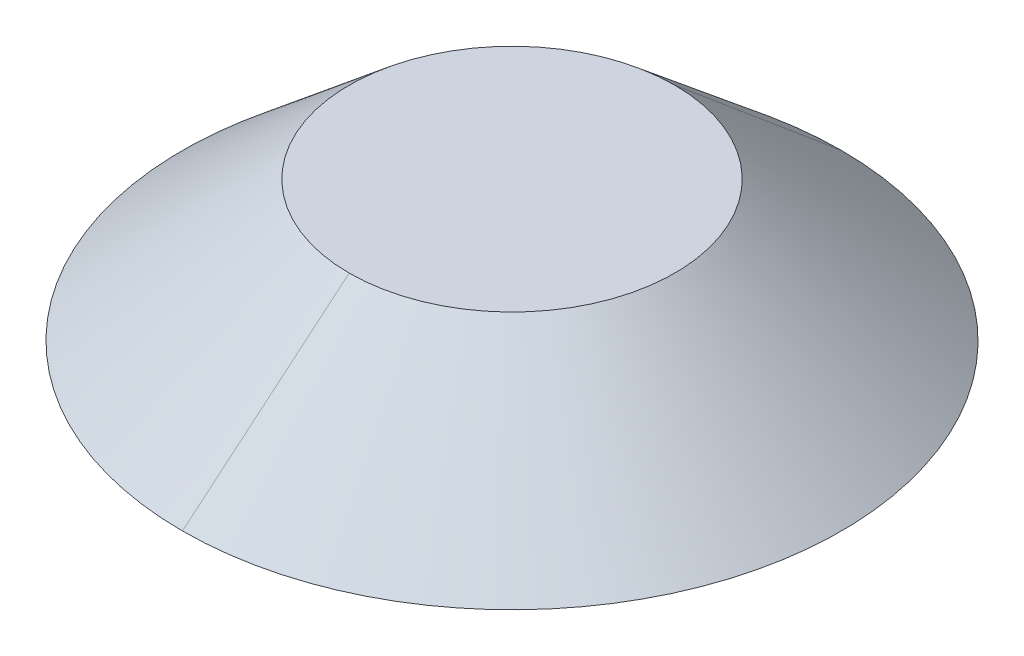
ISO-10303-21;
HEADER;
FILE_DESCRIPTION(('STEP AP214'),'2;1');
FILE_NAME('part.step','',(''),(''),'','','');
FILE_SCHEMA(('AUTOMOTIVE_DESIGN { 1 0 10303 214 1 1 1 1 }'));
ENDSEC;
DATA;
#1=APPLICATION_CONTEXT('core data for automotive mechanical design processes');
#2=APPLICATION_PROTOCOL_DEFINITION('international standard','automotive_design',2000,#1);
#3=PRODUCT_CONTEXT('',#1,'mechanical');
#4=PRODUCT('Part','Part','',(#3));
#5=PRODUCT_RELATED_PRODUCT_CATEGORY('part','',(#4));
#6=PRODUCT_DEFINITION_FORMATION('','',#4);
#7=PRODUCT_DEFINITION_CONTEXT('part definition',#1,'design');
#8=PRODUCT_DEFINITION('design','',#6,#7);
#9=PRODUCT_DEFINITION_SHAPE('','',#8);
#10=(LENGTH_UNIT() NAMED_UNIT(*) SI_UNIT(.MILLI.,.METRE.));
#11=(NAMED_UNIT(*) PLANE_ANGLE_UNIT() SI_UNIT($,.RADIAN.));
#12=(NAMED_UNIT(*) SI_UNIT($,.STERADIAN.) SOLID_ANGLE_UNIT());
#13=UNCERTAINTY_MEASURE_WITH_UNIT(LENGTH_MEASURE(1.E-05),#10,'distance_accuracy_value','');
#14=(GEOMETRIC_REPRESENTATION_CONTEXT(3) GLOBAL_UNCERTAINTY_ASSIGNED_CONTEXT((#13)) GLOBAL_UNIT_ASSIGNED_CONTEXT((#10,
#11,#12)) REPRESENTATION_CONTEXT('',''));
#15=CARTESIAN_POINT('',(0.,0.,0.));
#16=DIRECTION('',(0.,0.,1.));
#17=DIRECTION('',(1.,0.,0.));
#18=AXIS2_PLACEMENT_3D('',#15,#16,#17);
#19=CARTESIAN_POINT('',(0.,0.13853534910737,0.));
#20=DIRECTION('',(0.,-1.,0.));
#21=DIRECTION('',(0.,0.,-1.));
#22=AXIS2_PLACEMENT_3D('',#19,#20,#21);
#23=PLANE('',#22);
#24=CARTESIAN_POINT('',(0.,0.13853534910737,0.));
#25=DIRECTION('',(0.,-1.,0.));
#26=DIRECTION('',(0.,0.,-1.));
#27=AXIS2_PLACEMENT_3D('',#24,#25,#26);
#28=CIRCLE('',#27,2.0828);
#29=CARTESIAN_POINT('',(0.,0.13853534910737,-2.0828));
#30=VERTEX_POINT('',#29);
#31=CARTESIAN_POINT('',(0.,0.13853534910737,2.0828));
#32=VERTEX_POINT('',#31);
#33=EDGE_CURVE('E11',#30,#32,#28,.T.);
#34=ORIENTED_EDGE('',*,*,#33,.F.);
#35=CARTESIAN_POINT('',(0.,0.13853534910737,0.));
#36=DIRECTION('',(0.,-1.,0.));
#37=DIRECTION('',(0.,0.,-1.));
#38=AXIS2_PLACEMENT_3D('',#35,#36,#37);
#39=CIRCLE('',#38,2.0828);
#40=EDGE_CURVE('E25',#32,#30,#39,.T.);
#41=ORIENTED_EDGE('',*,*,#40,.F.);
#42=EDGE_LOOP('',(#34,#41));
#43=FACE_BOUND('',#42,.T.);
#44=ADVANCED_FACE('F17',(#43),#23,.F.);
#45=CARTESIAN_POINT('',(0.,0.13853534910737,0.));
#46=DIRECTION('',(0.,-1.,0.));
#47=DIRECTION('',(1.,0.,0.));
#48=AXIS2_PLACEMENT_3D('',#45,#46,#47);
#49=CONICAL_SURFACE('',#48,2.0828,0.872664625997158);
#50=ORIENTED_EDGE('',*,*,#40,.T.);
#51=CARTESIAN_POINT('',(0.,0.13853534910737,-2.0828));
#52=DIRECTION('',(0.,-0.642787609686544,-0.766044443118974));
#53=VECTOR('',#52,1.);
#54=LINE('',#51,#53);
#55=CARTESIAN_POINT('',(0.,-1.6517676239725,-4.2164));
#56=VERTEX_POINT('',#55);
#57=EDGE_CURVE('E301',#30,#56,#54,.T.);
#58=ORIENTED_EDGE('',*,*,#57,.T.);
#59=CARTESIAN_POINT('',(0.,-1.6517676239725,0.));
#60=DIRECTION('',(0.,-1.,0.));
#61=DIRECTION('',(0.,0.,-1.));
#62=AXIS2_PLACEMENT_3D('',#59,#60,#61);
#63=CIRCLE('',#62,4.2164);
#64=CARTESIAN_POINT('',(0.,-1.6517676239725,4.2164));
#65=VERTEX_POINT('',#64);
#66=EDGE_CURVE('E317',#65,#56,#63,.T.);
#67=ORIENTED_EDGE('',*,*,#66,.F.);
#68=CARTESIAN_POINT('',(0.,0.13853534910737,2.0828));
#69=DIRECTION('',(0.,-0.642787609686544,0.766044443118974));
#70=VECTOR('',#69,1.);
#71=LINE('',#68,#70);
#72=EDGE_CURVE('E304',#32,#65,#71,.T.);
#73=ORIENTED_EDGE('',*,*,#72,.F.);
#74=EDGE_LOOP('',(#50,#58,#67,#73));
#75=FACE_BOUND('',#74,.T.);
#76=ADVANCED_FACE('F285',(#75),#49,.T.);
#77=CARTESIAN_POINT('',(0.,0.13853534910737,0.));
#78=DIRECTION('',(0.,-1.,0.));
#79=DIRECTION('',(-1.,0.,0.));
#80=AXIS2_PLACEMENT_3D('',#77,#78,#79);
#81=CONICAL_SURFACE('',#80,2.0828,0.872664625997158);
#82=CARTESIAN_POINT('',(0.,-1.6517676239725,0.));
#83=DIRECTION('',(0.,-1.,0.));
#84=DIRECTION('',(0.,0.,-1.));
#85=AXIS2_PLACEMENT_3D('',#82,#83,#84);
#86=CIRCLE('',#85,4.2164);
#87=EDGE_CURVE('E266',#56,#65,#86,.T.);
#88=ORIENTED_EDGE('',*,*,#87,.F.);
#89=ORIENTED_EDGE('',*,*,#57,.F.);
#90=ORIENTED_EDGE('',*,*,#33,.T.);
#91=ORIENTED_EDGE('',*,*,#72,.T.);
#92=EDGE_LOOP('',(#88,#89,#90,#91));
#93=FACE_BOUND('',#92,.T.);
#94=ADVANCED_FACE('F275',(#93),#81,.T.);
#95=CARTESIAN_POINT('',(4.2164,-1.6517676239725,0.));
#96=DIRECTION('',(0.,1.,0.));
#97=DIRECTION('',(0.,0.,1.));
#98=AXIS2_PLACEMENT_3D('',#95,#96,#97);
#99=PLANE('',#98);
#100=DIRECTION('',(0.,0.,-1.));
#101=VECTOR('',#100,1.);
#102=CARTESIAN_POINT('',(2.58826,-1.6517676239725,0.));
#103=LINE('',#102,#101);
#104=CARTESIAN_POINT('',(2.58826,-1.6517676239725,0.52832));
#105=VERTEX_POINT('',#104);
#106=CARTESIAN_POINT('',(2.58826,-1.6517676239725,-0.52832));
#107=VERTEX_POINT('',#106);
#108=EDGE_CURVE('E262',#105,#107,#103,.T.);
#109=ORIENTED_EDGE('',*,*,#108,.T.);
#110=DIRECTION('',(1.,0.,0.));
#111=VECTOR('',#110,1.);
#112=CARTESIAN_POINT('',(0.78232,-1.6517676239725,-0.52832));
#113=LINE('',#112,#111);
#114=CARTESIAN_POINT('',(0.78232000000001,-1.6517676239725,-0.52832));
#115=VERTEX_POINT('',#114);
#116=EDGE_CURVE('E257',#115,#107,#113,.T.);
#117=ORIENTED_EDGE('',*,*,#116,.F.);
#118=CARTESIAN_POINT('',(0.78232000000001,-1.6517676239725,-0.78232000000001));
#119=DIRECTION('',(0.,-1.,0.));
#120=DIRECTION('',(1.,0.,0.));
#121=AXIS2_PLACEMENT_3D('',#118,#119,#120);
#122=CIRCLE('',#121,0.25400000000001);
#123=CARTESIAN_POINT('',(0.52832,-1.6517676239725,-0.78232));
#124=VERTEX_POINT('',#123);
#125=EDGE_CURVE('E253',#115,#124,#122,.T.);
#126=ORIENTED_EDGE('',*,*,#125,.T.);
#127=DIRECTION('',(0.,0.,1.));
#128=VECTOR('',#127,1.);
#129=CARTESIAN_POINT('',(0.52832,-1.6517676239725,-2.58826));
#130=LINE('',#129,#128);
#131=CARTESIAN_POINT('',(0.52832,-1.6517676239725,-2.58826));
#132=VERTEX_POINT('',#131);
#133=EDGE_CURVE('E248',#132,#124,#130,.T.);
#134=ORIENTED_EDGE('',*,*,#133,.F.);
#135=DIRECTION('',(1.,0.,0.));
#136=VECTOR('',#135,1.);
#137=CARTESIAN_POINT('',(-0.52832,-1.6517676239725,-2.58826));
#138=LINE('',#137,#136);
#139=CARTESIAN_POINT('',(-0.52832,-1.6517676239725,-2.58826));
#140=VERTEX_POINT('',#139);
#141=EDGE_CURVE('E243',#140,#132,#138,.T.);
#142=ORIENTED_EDGE('',*,*,#141,.F.);
#143=DIRECTION('',(0.,0.,-1.));
#144=VECTOR('',#143,1.);
#145=CARTESIAN_POINT('',(-0.52832,-1.6517676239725,-0.78232));
#146=LINE('',#145,#144);
#147=CARTESIAN_POINT('',(-0.52832,-1.6517676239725,-0.78232000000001));
#148=VERTEX_POINT('',#147);
#149=EDGE_CURVE('E238',#148,#140,#146,.T.);
#150=ORIENTED_EDGE('',*,*,#149,.F.);
#151=CARTESIAN_POINT('',(-0.78232000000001,-1.6517676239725,-0.78232000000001));
#152=DIRECTION('',(0.,-1.,0.));
#153=DIRECTION('',(1.,0.,0.));
#154=AXIS2_PLACEMENT_3D('',#151,#152,#153);
#155=CIRCLE('',#154,0.25400000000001);
#156=CARTESIAN_POINT('',(-0.78232,-1.6517676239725,-0.52832));
#157=VERTEX_POINT('',#156);
#158=EDGE_CURVE('E234',#148,#157,#155,.T.);
#159=ORIENTED_EDGE('',*,*,#158,.T.);
#160=DIRECTION('',(1.,0.,0.));
#161=VECTOR('',#160,1.);
#162=CARTESIAN_POINT('',(-2.58826,-1.6517676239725,-0.52832));
#163=LINE('',#162,#161);
#164=CARTESIAN_POINT('',(-2.58826,-1.6517676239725,-0.52832));
#165=VERTEX_POINT('',#164);
#166=EDGE_CURVE('E229',#165,#157,#163,.T.);
#167=ORIENTED_EDGE('',*,*,#166,.F.);
#168=DIRECTION('',(0.,0.,-1.));
#169=VECTOR('',#168,1.);
#170=CARTESIAN_POINT('',(-2.58826,-1.6517676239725,0.52832));
#171=LINE('',#170,#169);
#172=CARTESIAN_POINT('',(-2.58826,-1.6517676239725,0.52832));
#173=VERTEX_POINT('',#172);
#174=EDGE_CURVE('E224',#173,#165,#171,.T.);
#175=ORIENTED_EDGE('',*,*,#174,.F.);
#176=DIRECTION('',(-1.,0.,0.));
#177=VECTOR('',#176,1.);
#178=CARTESIAN_POINT('',(-0.78232,-1.6517676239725,0.52832));
#179=LINE('',#178,#177);
#180=CARTESIAN_POINT('',(-0.78232000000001,-1.6517676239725,0.52832));
#181=VERTEX_POINT('',#180);
#182=EDGE_CURVE('E220',#181,#173,#179,.T.);
#183=ORIENTED_EDGE('',*,*,#182,.F.);
#184=CARTESIAN_POINT('',(-0.78232000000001,-1.6517676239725,0.78232000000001));
#185=DIRECTION('',(0.,-1.,0.));
#186=DIRECTION('',(1.,0.,0.));
#187=AXIS2_PLACEMENT_3D('',#184,#185,#186);
#188=CIRCLE('',#187,0.25400000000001);
#189=CARTESIAN_POINT('',(-0.52832,-1.6517676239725,0.78232));
#190=VERTEX_POINT('',#189);
#191=EDGE_CURVE('E152',#181,#190,#188,.T.);
#192=ORIENTED_EDGE('',*,*,#191,.T.);
#193=DIRECTION('',(0.,0.,-1.));
#194=VECTOR('',#193,1.);
#195=CARTESIAN_POINT('',(-0.52832,-1.6517676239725,2.58826));
#196=LINE('',#195,#194);
#197=CARTESIAN_POINT('',(-0.52832,-1.6517676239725,2.58826));
#198=VERTEX_POINT('',#197);
#199=EDGE_CURVE('E212',#198,#190,#196,.T.);
#200=ORIENTED_EDGE('',*,*,#199,.F.);
#201=DIRECTION('',(-1.,0.,0.));
#202=VECTOR('',#201,1.);
#203=CARTESIAN_POINT('',(0.52832,-1.6517676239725,2.58826));
#204=LINE('',#203,#202);
#205=CARTESIAN_POINT('',(0.52832,-1.6517676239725,2.58826));
#206=VERTEX_POINT('',#205);
#207=EDGE_CURVE('E207',#206,#198,#204,.T.);
#208=ORIENTED_EDGE('',*,*,#207,.F.);
#209=DIRECTION('',(0.,0.,1.));
#210=VECTOR('',#209,1.);
#211=CARTESIAN_POINT('',(0.52832,-1.6517676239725,0.78232));
#212=LINE('',#211,#210);
#213=CARTESIAN_POINT('',(0.52832,-1.6517676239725,0.78232000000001));
#214=VERTEX_POINT('',#213);
#215=EDGE_CURVE('E202',#214,#206,#212,.T.);
#216=ORIENTED_EDGE('',*,*,#215,.F.);
#217=CARTESIAN_POINT('',(0.78232000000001,-1.6517676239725,0.78232000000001));
#218=DIRECTION('',(0.,-1.,0.));
#219=DIRECTION('',(1.,0.,0.));
#220=AXIS2_PLACEMENT_3D('',#217,#218,#219);
#221=CIRCLE('',#220,0.25400000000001);
#222=CARTESIAN_POINT('',(0.78232,-1.6517676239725,0.52832));
#223=VERTEX_POINT('',#222);
#224=EDGE_CURVE('E198',#214,#223,#221,.T.);
#225=ORIENTED_EDGE('',*,*,#224,.T.);
#226=DIRECTION('',(-1.,0.,0.));
#227=VECTOR('',#226,1.);
#228=CARTESIAN_POINT('',(2.58826,-1.6517676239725,0.52832));
#229=LINE('',#228,#227);
#230=EDGE_CURVE('E193',#105,#223,#229,.T.);
#231=ORIENTED_EDGE('',*,*,#230,.F.);
#232=EDGE_LOOP('',(#109,#117,#126,#134,#142,#150,#159,#167,#175,#183,#192,#200,#208,#216,#225,#231));
#233=FACE_BOUND('',#232,.T.);
#234=ORIENTED_EDGE('',*,*,#87,.T.);
#235=ORIENTED_EDGE('',*,*,#66,.T.);
#236=EDGE_LOOP('',(#234,#235));
#237=FACE_BOUND('',#236,.T.);
#238=ADVANCED_FACE('F284',(#233,#237),#99,.F.);
#239=CARTESIAN_POINT('',(2.58826,-0.732287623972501,0.52832));
#240=DIRECTION('',(0.,0.,1.));
#241=DIRECTION('',(1.,0.,0.));
#242=AXIS2_PLACEMENT_3D('',#239,#240,#241);
#243=PLANE('',#242);
#244=ORIENTED_EDGE('',*,*,#230,.T.);
#245=DIRECTION('',(0.,-1.,0.));
#246=VECTOR('',#245,1.);
#247=CARTESIAN_POINT('',(0.78232,-0.732287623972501,0.52832));
#248=LINE('',#247,#246);
#249=CARTESIAN_POINT('',(0.78232,-0.732287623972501,0.52832));
#250=VERTEX_POINT('',#249);
#251=EDGE_CURVE('E188',#250,#223,#248,.T.);
#252=ORIENTED_EDGE('',*,*,#251,.F.);
#253=DIRECTION('',(-1.,0.,0.));
#254=VECTOR('',#253,1.);
#255=CARTESIAN_POINT('',(2.58826,-0.732287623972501,0.52832));
#256=LINE('',#255,#254);
#257=CARTESIAN_POINT('',(2.58826,-0.732287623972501,0.52832));
#258=VERTEX_POINT('',#257);
#259=EDGE_CURVE('E183',#258,#250,#256,.T.);
#260=ORIENTED_EDGE('',*,*,#259,.F.);
#261=DIRECTION('',(0.,-1.,0.));
#262=VECTOR('',#261,1.);
#263=CARTESIAN_POINT('',(2.58826,-0.732287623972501,0.52832));
#264=LINE('',#263,#262);
#265=EDGE_CURVE('E178',#258,#105,#264,.T.);
#266=ORIENTED_EDGE('',*,*,#265,.T.);
#267=EDGE_LOOP('',(#244,#252,#260,#266));
#268=FACE_BOUND('',#267,.T.);
#269=ADVANCED_FACE('F363',(#268),#243,.F.);
#270=CARTESIAN_POINT('',(2.58826,-0.732287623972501,-0.52832));
#271=DIRECTION('',(1.,0.,0.));
#272=DIRECTION('',(0.,0.,-1.));
#273=AXIS2_PLACEMENT_3D('',#270,#271,#272);
#274=PLANE('',#273);
#275=DIRECTION('',(0.,-1.,0.));
#276=VECTOR('',#275,1.);
#277=CARTESIAN_POINT('',(2.58826,-0.732287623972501,-0.52832));
#278=LINE('',#277,#276);
#279=CARTESIAN_POINT('',(2.58826,-0.732287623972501,-0.52832));
#280=VERTEX_POINT('',#279);
#281=EDGE_CURVE('E165',#280,#107,#278,.T.);
#282=ORIENTED_EDGE('',*,*,#281,.T.);
#283=ORIENTED_EDGE('',*,*,#108,.F.);
#284=ORIENTED_EDGE('',*,*,#265,.F.);
#285=DIRECTION('',(0.,0.,1.));
#286=VECTOR('',#285,1.);
#287=CARTESIAN_POINT('',(2.58826,-0.732287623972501,-0.52832));
#288=LINE('',#287,#286);
#289=EDGE_CURVE('E161',#280,#258,#288,.T.);
#290=ORIENTED_EDGE('',*,*,#289,.F.);
#291=EDGE_LOOP('',(#282,#283,#284,#290));
#292=FACE_BOUND('',#291,.T.);
#293=ADVANCED_FACE('F372',(#292),#274,.F.);
#294=CARTESIAN_POINT('',(-0.78232000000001,-0.732287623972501,-0.78232000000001));
#295=DIRECTION('',(0.,-1.,0.));
#296=DIRECTION('',(0.,0.,-1.));
#297=AXIS2_PLACEMENT_3D('',#294,#295,#296);
#298=PLANE('',#297);
#299=DIRECTION('',(-1.,0.,0.));
#300=VECTOR('',#299,1.);
#301=CARTESIAN_POINT('',(-0.78232,-0.732287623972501,0.52832));
#302=LINE('',#301,#300);
#303=CARTESIAN_POINT('',(-0.78232000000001,-0.732287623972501,0.52832));
#304=VERTEX_POINT('',#303);
#305=CARTESIAN_POINT('',(-2.58826,-0.732287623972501,0.52832));
#306=VERTEX_POINT('',#305);
#307=EDGE_CURVE('E140',#304,#306,#302,.T.);
#308=ORIENTED_EDGE('',*,*,#307,.T.);
#309=DIRECTION('',(0.,0.,-1.));
#310=VECTOR('',#309,1.);
#311=CARTESIAN_POINT('',(-2.58826,-0.732287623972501,0.52832));
#312=LINE('',#311,#310);
#313=CARTESIAN_POINT('',(-2.58826,-0.732287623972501,-0.52832));
#314=VERTEX_POINT('',#313);
#315=EDGE_CURVE('E162',#306,#314,#312,.T.);
#316=ORIENTED_EDGE('',*,*,#315,.T.);
#317=DIRECTION('',(1.,0.,0.));
#318=VECTOR('',#317,1.);
#319=CARTESIAN_POINT('',(-2.58826,-0.732287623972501,-0.52832));
#320=LINE('',#319,#318);
#321=CARTESIAN_POINT('',(-0.78232,-0.732287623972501,-0.52832));
#322=VERTEX_POINT('',#321);
#323=EDGE_CURVE('E167',#314,#322,#320,.T.);
#324=ORIENTED_EDGE('',*,*,#323,.T.);
#325=CARTESIAN_POINT('',(-0.78232000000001,-0.732287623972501,-0.78232000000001));
#326=DIRECTION('',(0.,-1.,0.));
#327=DIRECTION('',(1.,0.,0.));
#328=AXIS2_PLACEMENT_3D('',#325,#326,#327);
#329=CIRCLE('',#328,0.25400000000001);
#330=CARTESIAN_POINT('',(-0.52832,-0.732287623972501,-0.78232000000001));
#331=VERTEX_POINT('',#330);
#332=EDGE_CURVE('E681',#331,#322,#329,.T.);
#333=ORIENTED_EDGE('',*,*,#332,.F.);
#334=DIRECTION('',(0.,0.,-1.));
#335=VECTOR('',#334,1.);
#336=CARTESIAN_POINT('',(-0.52832,-0.732287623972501,-0.78232));
#337=LINE('',#336,#335);
#338=CARTESIAN_POINT('',(-0.52832,-0.732287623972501,-2.58826));
#339=VERTEX_POINT('',#338);
#340=EDGE_CURVE('E677',#331,#339,#337,.T.);
#341=ORIENTED_EDGE('',*,*,#340,.T.);
#342=DIRECTION('',(1.,0.,0.));
#343=VECTOR('',#342,1.);
#344=CARTESIAN_POINT('',(-0.52832,-0.732287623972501,-2.58826));
#345=LINE('',#344,#343);
#346=CARTESIAN_POINT('',(0.52832,-0.732287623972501,-2.58826));
#347=VERTEX_POINT('',#346);
#348=EDGE_CURVE('E673',#339,#347,#345,.T.);
#349=ORIENTED_EDGE('',*,*,#348,.T.);
#350=DIRECTION('',(0.,0.,1.));
#351=VECTOR('',#350,1.);
#352=CARTESIAN_POINT('',(0.52832,-0.732287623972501,-2.58826));
#353=LINE('',#352,#351);
#354=CARTESIAN_POINT('',(0.52832,-0.732287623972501,-0.78232));
#355=VERTEX_POINT('',#354);
#356=EDGE_CURVE('E669',#347,#355,#353,.T.);
#357=ORIENTED_EDGE('',*,*,#356,.T.);
#358=CARTESIAN_POINT('',(0.78232000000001,-0.732287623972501,-0.78232000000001));
#359=DIRECTION('',(0.,-1.,0.));
#360=DIRECTION('',(1.,0.,0.));
#361=AXIS2_PLACEMENT_3D('',#358,#359,#360);
#362=CIRCLE('',#361,0.25400000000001);
#363=CARTESIAN_POINT('',(0.78232000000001,-0.732287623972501,-0.52832));
#364=VERTEX_POINT('',#363);
#365=EDGE_CURVE('E588',#364,#355,#362,.T.);
#366=ORIENTED_EDGE('',*,*,#365,.F.);
#367=DIRECTION('',(1.,0.,0.));
#368=VECTOR('',#367,1.);
#369=CARTESIAN_POINT('',(0.78232,-0.732287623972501,-0.52832));
#370=LINE('',#369,#368);
#371=EDGE_CURVE('E661',#364,#280,#370,.T.);
#372=ORIENTED_EDGE('',*,*,#371,.T.);
#373=ORIENTED_EDGE('',*,*,#289,.T.);
#374=ORIENTED_EDGE('',*,*,#259,.T.);
#375=CARTESIAN_POINT('',(0.78232000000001,-0.732287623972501,0.78232000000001));
#376=DIRECTION('',(0.,-1.,0.));
#377=DIRECTION('',(1.,0.,0.));
#378=AXIS2_PLACEMENT_3D('',#375,#376,#377);
#379=CIRCLE('',#378,0.25400000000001);
#380=CARTESIAN_POINT('',(0.52832,-0.732287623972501,0.78232000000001));
#381=VERTEX_POINT('',#380);
#382=EDGE_CURVE('E656',#381,#250,#379,.T.);
#383=ORIENTED_EDGE('',*,*,#382,.F.);
#384=DIRECTION('',(0.,0.,1.));
#385=VECTOR('',#384,1.);
#386=CARTESIAN_POINT('',(0.52832,-0.732287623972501,0.78232));
#387=LINE('',#386,#385);
#388=CARTESIAN_POINT('',(0.52832,-0.732287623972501,2.58826));
#389=VERTEX_POINT('',#388);
#390=EDGE_CURVE('E652',#381,#389,#387,.T.);
#391=ORIENTED_EDGE('',*,*,#390,.T.);
#392=DIRECTION('',(-1.,0.,0.));
#393=VECTOR('',#392,1.);
#394=CARTESIAN_POINT('',(0.52832,-0.732287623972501,2.58826));
#395=LINE('',#394,#393);
#396=CARTESIAN_POINT('',(-0.52832,-0.732287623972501,2.58826));
#397=VERTEX_POINT('',#396);
#398=EDGE_CURVE('E648',#389,#397,#395,.T.);
#399=ORIENTED_EDGE('',*,*,#398,.T.);
#400=DIRECTION('',(0.,0.,-1.));
#401=VECTOR('',#400,1.);
#402=CARTESIAN_POINT('',(-0.52832,-0.732287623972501,2.58826));
#403=LINE('',#402,#401);
#404=CARTESIAN_POINT('',(-0.52832,-0.732287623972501,0.78232));
#405=VERTEX_POINT('',#404);
#406=EDGE_CURVE('E143',#397,#405,#403,.T.);
#407=ORIENTED_EDGE('',*,*,#406,.T.);
#408=CARTESIAN_POINT('',(-0.78232000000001,-0.732287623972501,0.78232000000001));
#409=DIRECTION('',(0.,-1.,0.));
#410=DIRECTION('',(1.,0.,0.));
#411=AXIS2_PLACEMENT_3D('',#408,#409,#410);
#412=CIRCLE('',#411,0.25400000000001);
#413=EDGE_CURVE('E136',#304,#405,#412,.T.);
#414=ORIENTED_EDGE('',*,*,#413,.F.);
#415=EDGE_LOOP('',(#308,#316,#324,#333,#341,#349,#357,#366,#372,#373,#374,#383,#391,#399,#407,#414));
#416=FACE_BOUND('',#415,.T.);
#417=ADVANCED_FACE('F138',(#416),#298,.T.);
#418=CARTESIAN_POINT('',(-0.78232000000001,-0.732287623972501,0.78232000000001));
#419=DIRECTION('',(0.,1.,0.));
#420=DIRECTION('',(-0.707106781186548,0.,0.707106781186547));
#421=AXIS2_PLACEMENT_3D('',#418,#419,#420);
#422=CYLINDRICAL_SURFACE('',#421,0.25400000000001);
#423=ORIENTED_EDGE('',*,*,#191,.F.);
#424=DIRECTION('',(0.,-1.,0.));
#425=VECTOR('',#424,1.);
#426=CARTESIAN_POINT('',(-0.78232000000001,-0.732287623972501,0.52832));
#427=LINE('',#426,#425);
#428=EDGE_CURVE('E147',#304,#181,#427,.T.);
#429=ORIENTED_EDGE('',*,*,#428,.F.);
#430=ORIENTED_EDGE('',*,*,#413,.T.);
#431=DIRECTION('',(0.,-1.,0.));
#432=VECTOR('',#431,1.);
#433=CARTESIAN_POINT('',(-0.52832,-0.732287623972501,0.78232));
#434=LINE('',#433,#432);
#435=EDGE_CURVE('E155',#405,#190,#434,.T.);
#436=ORIENTED_EDGE('',*,*,#435,.T.);
#437=EDGE_LOOP('',(#423,#429,#430,#436));
#438=FACE_BOUND('',#437,.T.);
#439=ADVANCED_FACE('F151',(#438),#422,.T.);
#440=CARTESIAN_POINT('',(-0.52832,-0.732287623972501,2.58826));
#441=DIRECTION('',(-1.,0.,0.));
#442=DIRECTION('',(0.,0.,1.));
#443=AXIS2_PLACEMENT_3D('',#440,#441,#442);
#444=PLANE('',#443);
#445=ORIENTED_EDGE('',*,*,#199,.T.);
#446=ORIENTED_EDGE('',*,*,#435,.F.);
#447=ORIENTED_EDGE('',*,*,#406,.F.);
#448=DIRECTION('',(0.,-1.,0.));
#449=VECTOR('',#448,1.);
#450=CARTESIAN_POINT('',(-0.52832,-0.732287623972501,2.58826));
#451=LINE('',#450,#449);
#452=EDGE_CURVE('E633',#397,#198,#451,.T.);
#453=ORIENTED_EDGE('',*,*,#452,.T.);
#454=EDGE_LOOP('',(#445,#446,#447,#453));
#455=FACE_BOUND('',#454,.T.);
#456=ADVANCED_FACE('F398',(#455),#444,.F.);
#457=CARTESIAN_POINT('',(0.52832,-0.732287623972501,2.58826));
#458=DIRECTION('',(0.,0.,1.));
#459=DIRECTION('',(1.,0.,0.));
#460=AXIS2_PLACEMENT_3D('',#457,#458,#459);
#461=PLANE('',#460);
#462=ORIENTED_EDGE('',*,*,#207,.T.);
#463=ORIENTED_EDGE('',*,*,#452,.F.);
#464=ORIENTED_EDGE('',*,*,#398,.F.);
#465=DIRECTION('',(0.,-1.,0.));
#466=VECTOR('',#465,1.);
#467=CARTESIAN_POINT('',(0.52832,-0.732287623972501,2.58826));
#468=LINE('',#467,#466);
#469=EDGE_CURVE('E628',#389,#206,#468,.T.);
#470=ORIENTED_EDGE('',*,*,#469,.T.);
#471=EDGE_LOOP('',(#462,#463,#464,#470));
#472=FACE_BOUND('',#471,.T.);
#473=ADVANCED_FACE('F407',(#472),#461,.F.);
#474=CARTESIAN_POINT('',(0.52832,-0.732287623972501,0.78232));
#475=DIRECTION('',(1.,0.,0.));
#476=DIRECTION('',(0.,0.,-1.));
#477=AXIS2_PLACEMENT_3D('',#474,#475,#476);
#478=PLANE('',#477);
#479=ORIENTED_EDGE('',*,*,#215,.T.);
#480=ORIENTED_EDGE('',*,*,#469,.F.);
#481=ORIENTED_EDGE('',*,*,#390,.F.);
#482=DIRECTION('',(0.,-1.,0.));
#483=VECTOR('',#482,1.);
#484=CARTESIAN_POINT('',(0.52832,-0.732287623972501,0.78232000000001));
#485=LINE('',#484,#483);
#486=EDGE_CURVE('E623',#381,#214,#485,.T.);
#487=ORIENTED_EDGE('',*,*,#486,.T.);
#488=EDGE_LOOP('',(#479,#480,#481,#487));
#489=FACE_BOUND('',#488,.T.);
#490=ADVANCED_FACE('F417',(#489),#478,.F.);
#491=CARTESIAN_POINT('',(0.78232000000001,-0.732287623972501,0.78232000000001));
#492=DIRECTION('',(0.,1.,0.));
#493=DIRECTION('',(0.707106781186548,0.,0.707106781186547));
#494=AXIS2_PLACEMENT_3D('',#491,#492,#493);
#495=CYLINDRICAL_SURFACE('',#494,0.25400000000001);
#496=ORIENTED_EDGE('',*,*,#224,.F.);
#497=ORIENTED_EDGE('',*,*,#486,.F.);
#498=ORIENTED_EDGE('',*,*,#382,.T.);
#499=ORIENTED_EDGE('',*,*,#251,.T.);
#500=EDGE_LOOP('',(#496,#497,#498,#499));
#501=FACE_BOUND('',#500,.T.);
#502=ADVANCED_FACE('F427',(#501),#495,.T.);
#503=CARTESIAN_POINT('',(-0.78232,-0.732287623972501,0.52832));
#504=DIRECTION('',(0.,0.,1.));
#505=DIRECTION('',(1.,0.,0.));
#506=AXIS2_PLACEMENT_3D('',#503,#504,#505);
#507=PLANE('',#506);
#508=ORIENTED_EDGE('',*,*,#182,.T.);
#509=DIRECTION('',(0.,-1.,0.));
#510=VECTOR('',#509,1.);
#511=CARTESIAN_POINT('',(-2.58826,-0.732287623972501,0.52832));
#512=LINE('',#511,#510);
#513=EDGE_CURVE('E159',#306,#173,#512,.T.);
#514=ORIENTED_EDGE('',*,*,#513,.F.);
#515=ORIENTED_EDGE('',*,*,#307,.F.);
#516=ORIENTED_EDGE('',*,*,#428,.T.);
#517=EDGE_LOOP('',(#508,#514,#515,#516));
#518=FACE_BOUND('',#517,.T.);
#519=ADVANCED_FACE('F157',(#518),#507,.F.);
#520=CARTESIAN_POINT('',(-2.58826,-0.732287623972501,0.52832));
#521=DIRECTION('',(-1.,0.,0.));
#522=DIRECTION('',(0.,0.,1.));
#523=AXIS2_PLACEMENT_3D('',#520,#521,#522);
#524=PLANE('',#523);
#525=ORIENTED_EDGE('',*,*,#174,.T.);
#526=DIRECTION('',(0.,-1.,0.));
#527=VECTOR('',#526,1.);
#528=CARTESIAN_POINT('',(-2.58826,-0.732287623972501,-0.52832));
#529=LINE('',#528,#527);
#530=EDGE_CURVE('E615',#314,#165,#529,.T.);
#531=ORIENTED_EDGE('',*,*,#530,.F.);
#532=ORIENTED_EDGE('',*,*,#315,.F.);
#533=ORIENTED_EDGE('',*,*,#513,.T.);
#534=EDGE_LOOP('',(#525,#531,#532,#533));
#535=FACE_BOUND('',#534,.T.);
#536=ADVANCED_FACE('F446',(#535),#524,.F.);
#537=CARTESIAN_POINT('',(-2.58826,-0.732287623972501,-0.52832));
#538=DIRECTION('',(0.,0.,-1.));
#539=DIRECTION('',(-1.,0.,0.));
#540=AXIS2_PLACEMENT_3D('',#537,#538,#539);
#541=PLANE('',#540);
#542=ORIENTED_EDGE('',*,*,#166,.T.);
#543=DIRECTION('',(0.,-1.,0.));
#544=VECTOR('',#543,1.);
#545=CARTESIAN_POINT('',(-0.78232,-0.732287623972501,-0.52832));
#546=LINE('',#545,#544);
#547=EDGE_CURVE('E610',#322,#157,#546,.T.);
#548=ORIENTED_EDGE('',*,*,#547,.F.);
#549=ORIENTED_EDGE('',*,*,#323,.F.);
#550=ORIENTED_EDGE('',*,*,#530,.T.);
#551=EDGE_LOOP('',(#542,#548,#549,#550));
#552=FACE_BOUND('',#551,.T.);
#553=ADVANCED_FACE('F455',(#552),#541,.F.);
#554=CARTESIAN_POINT('',(-0.78232000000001,-0.732287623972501,-0.78232000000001));
#555=DIRECTION('',(0.,1.,0.));
#556=DIRECTION('',(-0.707106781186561,0.,-0.707106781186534));
#557=AXIS2_PLACEMENT_3D('',#554,#555,#556);
#558=CYLINDRICAL_SURFACE('',#557,0.25400000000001);
#559=ORIENTED_EDGE('',*,*,#158,.F.);
#560=DIRECTION('',(0.,-1.,0.));
#561=VECTOR('',#560,1.);
#562=CARTESIAN_POINT('',(-0.52832,-0.732287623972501,-0.78232000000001));
#563=LINE('',#562,#561);
#564=EDGE_CURVE('E605',#331,#148,#563,.T.);
#565=ORIENTED_EDGE('',*,*,#564,.F.);
#566=ORIENTED_EDGE('',*,*,#332,.T.);
#567=ORIENTED_EDGE('',*,*,#547,.T.);
#568=EDGE_LOOP('',(#559,#565,#566,#567));
#569=FACE_BOUND('',#568,.T.);
#570=ADVANCED_FACE('F465',(#569),#558,.T.);
#571=CARTESIAN_POINT('',(-0.52832,-0.732287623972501,-0.78232));
#572=DIRECTION('',(-1.,0.,0.));
#573=DIRECTION('',(0.,0.,1.));
#574=AXIS2_PLACEMENT_3D('',#571,#572,#573);
#575=PLANE('',#574);
#576=ORIENTED_EDGE('',*,*,#149,.T.);
#577=DIRECTION('',(0.,-1.,0.));
#578=VECTOR('',#577,1.);
#579=CARTESIAN_POINT('',(-0.52832,-0.732287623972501,-2.58826));
#580=LINE('',#579,#578);
#581=EDGE_CURVE('E593',#339,#140,#580,.T.);
#582=ORIENTED_EDGE('',*,*,#581,.F.);
#583=ORIENTED_EDGE('',*,*,#340,.F.);
#584=ORIENTED_EDGE('',*,*,#564,.T.);
#585=EDGE_LOOP('',(#576,#582,#583,#584));
#586=FACE_BOUND('',#585,.T.);
#587=ADVANCED_FACE('F475',(#586),#575,.F.);
#588=CARTESIAN_POINT('',(-0.52832,-0.732287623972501,-2.58826));
#589=DIRECTION('',(0.,0.,-1.));
#590=DIRECTION('',(-1.,0.,0.));
#591=AXIS2_PLACEMENT_3D('',#588,#589,#590);
#592=PLANE('',#591);
#593=ORIENTED_EDGE('',*,*,#141,.T.);
#594=DIRECTION('',(0.,-1.,0.));
#595=VECTOR('',#594,1.);
#596=CARTESIAN_POINT('',(0.52832,-0.732287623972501,-2.58826));
#597=LINE('',#596,#595);
#598=EDGE_CURVE('E590',#347,#132,#597,.T.);
#599=ORIENTED_EDGE('',*,*,#598,.F.);
#600=ORIENTED_EDGE('',*,*,#348,.F.);
#601=ORIENTED_EDGE('',*,*,#581,.T.);
#602=EDGE_LOOP('',(#593,#599,#600,#601));
#603=FACE_BOUND('',#602,.T.);
#604=ADVANCED_FACE('F485',(#603),#592,.F.);
#605=CARTESIAN_POINT('',(0.52832,-0.732287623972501,-2.58826));
#606=DIRECTION('',(1.,0.,0.));
#607=DIRECTION('',(0.,0.,-1.));
#608=AXIS2_PLACEMENT_3D('',#605,#606,#607);
#609=PLANE('',#608);
#610=ORIENTED_EDGE('',*,*,#133,.T.);
#611=DIRECTION('',(0.,-1.,0.));
#612=VECTOR('',#611,1.);
#613=CARTESIAN_POINT('',(0.52832,-0.732287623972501,-0.78232));
#614=LINE('',#613,#612);
#615=EDGE_CURVE('E587',#355,#124,#614,.T.);
#616=ORIENTED_EDGE('',*,*,#615,.F.);
#617=ORIENTED_EDGE('',*,*,#356,.F.);
#618=ORIENTED_EDGE('',*,*,#598,.T.);
#619=EDGE_LOOP('',(#610,#616,#617,#618));
#620=FACE_BOUND('',#619,.T.);
#621=ADVANCED_FACE('F495',(#620),#609,.F.);
#622=CARTESIAN_POINT('',(0.78232000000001,-0.732287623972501,-0.78232000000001));
#623=DIRECTION('',(0.,1.,0.));
#624=DIRECTION('',(0.707106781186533,0.,-0.707106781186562));
#625=AXIS2_PLACEMENT_3D('',#622,#623,#624);
#626=CYLINDRICAL_SURFACE('',#625,0.25400000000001);
#627=ORIENTED_EDGE('',*,*,#125,.F.);
#628=DIRECTION('',(0.,-1.,0.));
#629=VECTOR('',#628,1.);
#630=CARTESIAN_POINT('',(0.78232000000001,-0.732287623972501,-0.52832));
#631=LINE('',#630,#629);
#632=EDGE_CURVE('E580',#364,#115,#631,.T.);
#633=ORIENTED_EDGE('',*,*,#632,.F.);
#634=ORIENTED_EDGE('',*,*,#365,.T.);
#635=ORIENTED_EDGE('',*,*,#615,.T.);
#636=EDGE_LOOP('',(#627,#633,#634,#635));
#637=FACE_BOUND('',#636,.T.);
#638=ADVANCED_FACE('F505',(#637),#626,.T.);
#639=CARTESIAN_POINT('',(0.78232,-0.732287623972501,-0.52832));
#640=DIRECTION('',(0.,0.,-1.));
#641=DIRECTION('',(-1.,0.,0.));
#642=AXIS2_PLACEMENT_3D('',#639,#640,#641);
#643=PLANE('',#642);
#644=ORIENTED_EDGE('',*,*,#116,.T.);
#645=ORIENTED_EDGE('',*,*,#281,.F.);
#646=ORIENTED_EDGE('',*,*,#371,.F.);
#647=ORIENTED_EDGE('',*,*,#632,.T.);
#648=EDGE_LOOP('',(#644,#645,#646,#647));
#649=FACE_BOUND('',#648,.T.);
#650=ADVANCED_FACE('F515',(#649),#643,.F.);
#651=CLOSED_SHELL('',(#44,#76,#94,#238,#269,#293,#417,#439,#456,#473,#490,#502,#519,#536,#553,
#570,#587,#604,#621,#638,#650));
#652=MANIFOLD_SOLID_BREP('B1',#651);
#653=ADVANCED_BREP_SHAPE_REPRESENTATION('',(#18,#652),#14);
#654=SHAPE_DEFINITION_REPRESENTATION(#9,#653);
ENDSEC;
END-ISO-10303-21;
